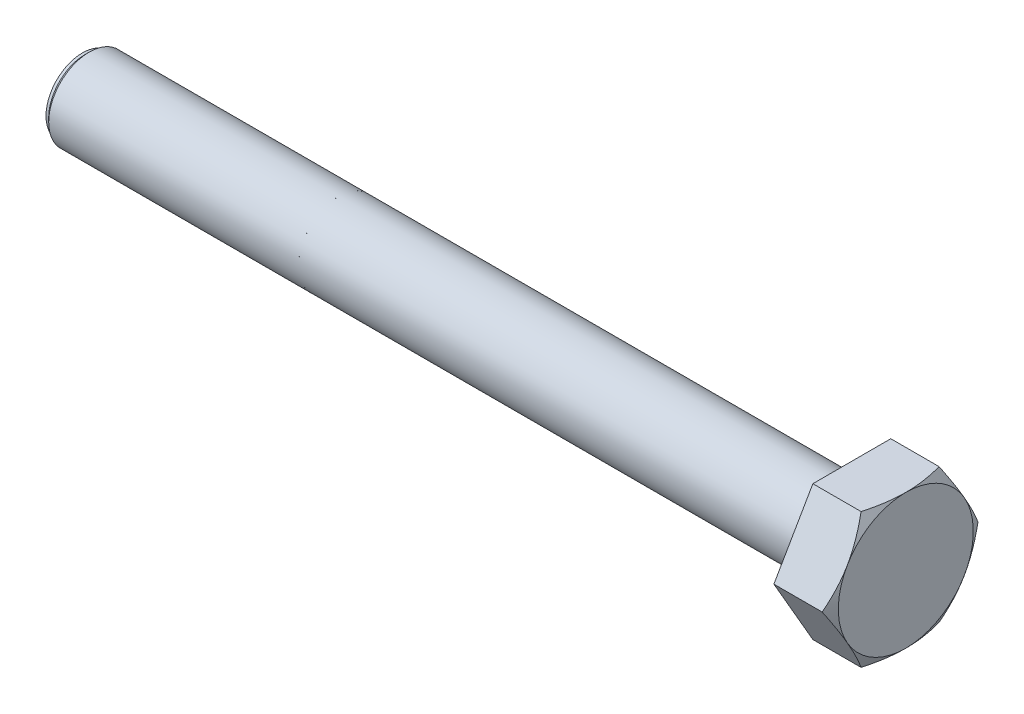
ISO-10303-21;
HEADER;
FILE_DESCRIPTION(('STEP AP214'),'2;1');
FILE_NAME('part.step','',(''),(''),'','','');
FILE_SCHEMA(('AUTOMOTIVE_DESIGN { 1 0 10303 214 1 1 1 1 }'));
ENDSEC;
DATA;
#1=APPLICATION_CONTEXT('core data for automotive mechanical design processes');
#2=APPLICATION_PROTOCOL_DEFINITION('international standard','automotive_design',2000,#1);
#3=PRODUCT_CONTEXT('',#1,'mechanical');
#4=PRODUCT('Part','Part','',(#3));
#5=PRODUCT_RELATED_PRODUCT_CATEGORY('part','',(#4));
#6=PRODUCT_DEFINITION_FORMATION('','',#4);
#7=PRODUCT_DEFINITION_CONTEXT('part definition',#1,'design');
#8=PRODUCT_DEFINITION('design','',#6,#7);
#9=PRODUCT_DEFINITION_SHAPE('','',#8);
#10=(LENGTH_UNIT() NAMED_UNIT(*) SI_UNIT(.MILLI.,.METRE.));
#11=(NAMED_UNIT(*) PLANE_ANGLE_UNIT() SI_UNIT($,.RADIAN.));
#12=(NAMED_UNIT(*) SI_UNIT($,.STERADIAN.) SOLID_ANGLE_UNIT());
#13=UNCERTAINTY_MEASURE_WITH_UNIT(LENGTH_MEASURE(1.E-05),#10,'distance_accuracy_value','');
#14=(GEOMETRIC_REPRESENTATION_CONTEXT(3) GLOBAL_UNCERTAINTY_ASSIGNED_CONTEXT((#13)) GLOBAL_UNIT_ASSIGNED_CONTEXT((#10,
#11,#12)) REPRESENTATION_CONTEXT('',''));
#15=CARTESIAN_POINT('',(0.,0.,0.));
#16=DIRECTION('',(0.,0.,1.));
#17=DIRECTION('',(1.,0.,0.));
#18=AXIS2_PLACEMENT_3D('',#15,#16,#17);
#19=CARTESIAN_POINT('',(-57.,0.,0.));
#20=DIRECTION('',(-1.,0.,0.));
#21=DIRECTION('',(0.,0.,1.));
#22=AXIS2_PLACEMENT_3D('',#19,#20,#21);
#23=CYLINDRICAL_SURFACE('',#22,2.7);
#24=CARTESIAN_POINT('',(-38.,0.,0.));
#25=DIRECTION('',(-1.,0.,0.));
#26=DIRECTION('',(0.,0.,1.));
#27=AXIS2_PLACEMENT_3D('',#24,#25,#26);
#28=CIRCLE('',#27,2.7);
#29=CARTESIAN_POINT('',(-38.,0.,2.7));
#30=VERTEX_POINT('',#29);
#31=EDGE_CURVE('P0_E20',#30,#30,#28,.T.);
#32=ORIENTED_EDGE('',*,*,#31,.T.);
#33=EDGE_LOOP('',(#32));
#34=FACE_BOUND('',#33,.T.);
#35=CARTESIAN_POINT('',(-57.,0.,0.));
#36=DIRECTION('',(-1.,0.,0.));
#37=DIRECTION('',(0.,0.,1.));
#38=AXIS2_PLACEMENT_3D('',#35,#36,#37);
#39=CIRCLE('',#38,2.7);
#40=CARTESIAN_POINT('',(-57.,0.,2.7));
#41=VERTEX_POINT('',#40);
#42=EDGE_CURVE('P0_E11',#41,#41,#39,.F.);
#43=ORIENTED_EDGE('',*,*,#42,.T.);
#44=EDGE_LOOP('',(#43));
#45=FACE_BOUND('',#44,.T.);
#46=ADVANCED_FACE('P0_F16',(#34,#45),#23,.T.);
#47=CARTESIAN_POINT('',(-38.,0.,0.));
#48=DIRECTION('',(-1.,0.,0.));
#49=DIRECTION('',(0.,0.,1.));
#50=AXIS2_PLACEMENT_3D('',#47,#48,#49);
#51=PLANE('',#50);
#52=ORIENTED_EDGE('',*,*,#31,.F.);
#53=EDGE_LOOP('',(#52));
#54=FACE_BOUND('',#53,.T.);
#55=CARTESIAN_POINT('',(-38.,3.,0.));
#56=CARTESIAN_POINT('',(-38.,2.99979758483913,-0.572474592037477));
#57=CARTESIAN_POINT('',(-38.,2.78936490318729,-1.10428412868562));
#58=CARTESIAN_POINT('',(-38.,2.56095382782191,-1.6815290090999));
#59=CARTESIAN_POINT('',(-38.,2.12132034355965,-2.12132034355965));
#60=CARTESIAN_POINT('',(-38.,1.68243191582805,-2.5603663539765));
#61=CARTESIAN_POINT('',(-38.,1.10428412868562,-2.78936490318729));
#62=CARTESIAN_POINT('',(-38.,0.572753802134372,-2.99989874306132));
#63=CARTESIAN_POINT('',(-38.,0.,-3.));
#64=CARTESIAN_POINT('',(-38.,-0.571707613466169,-3.00010107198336));
#65=CARTESIAN_POINT('',(-38.,-1.10428412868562,-2.78936490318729));
#66=CARTESIAN_POINT('',(-38.,-1.68152900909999,-2.56095382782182));
#67=CARTESIAN_POINT('',(-38.,-2.12132034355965,-2.12132034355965));
#68=CARTESIAN_POINT('',(-38.,-2.56036635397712,-1.68243191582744));
#69=CARTESIAN_POINT('',(-38.,-2.78936490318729,-1.10428412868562));
#70=CARTESIAN_POINT('',(-38.,-2.999797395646,-0.573009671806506));
#71=CARTESIAN_POINT('',(-38.,-3.,0.));
#72=B_SPLINE_CURVE_WITH_KNOTS('',2,(#55,#56,#57,#58,#59,#60,#61,#62,#63,#64,#65,#66,#67,#68,#69,
#70,#71),.UNSPECIFIED.,.F.,.F.,(3,2,2,2,2,2,2,2,3),(0.,0.125,0.25,0.375,0.5,0.625,0.75,0.875,
1.),.UNSPECIFIED.);
#73=CARTESIAN_POINT('',(-38.,3.,0.));
#74=VERTEX_POINT('',#73);
#75=CARTESIAN_POINT('',(-38.,-3.,0.));
#76=VERTEX_POINT('',#75);
#77=EDGE_CURVE('P0_E30',#74,#76,#72,.T.);
#78=ORIENTED_EDGE('',*,*,#77,.T.);
#79=CARTESIAN_POINT('',(-38.,-3.,0.));
#80=CARTESIAN_POINT('',(-38.,-2.99979758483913,0.572474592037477));
#81=CARTESIAN_POINT('',(-38.,-2.78936490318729,1.10428412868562));
#82=CARTESIAN_POINT('',(-38.,-2.56095382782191,1.6815290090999));
#83=CARTESIAN_POINT('',(-38.,-2.12132034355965,2.12132034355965));
#84=CARTESIAN_POINT('',(-38.,-1.68243191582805,2.5603663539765));
#85=CARTESIAN_POINT('',(-38.,-1.10428412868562,2.78936490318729));
#86=CARTESIAN_POINT('',(-38.,-0.572753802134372,2.99989874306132));
#87=CARTESIAN_POINT('',(-38.,0.,3.));
#88=CARTESIAN_POINT('',(-38.,0.571707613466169,3.00010107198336));
#89=CARTESIAN_POINT('',(-38.,1.10428412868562,2.78936490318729));
#90=CARTESIAN_POINT('',(-38.,1.68152900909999,2.56095382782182));
#91=CARTESIAN_POINT('',(-38.,2.12132034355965,2.12132034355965));
#92=CARTESIAN_POINT('',(-38.,2.56036635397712,1.68243191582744));
#93=CARTESIAN_POINT('',(-38.,2.78936490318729,1.10428412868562));
#94=CARTESIAN_POINT('',(-38.,2.999797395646,0.573009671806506));
#95=CARTESIAN_POINT('',(-38.,3.,0.));
#96=B_SPLINE_CURVE_WITH_KNOTS('',2,(#79,#80,#81,#82,#83,#84,#85,#86,#87,#88,#89,#90,#91,#92,#93,
#94,#95),.UNSPECIFIED.,.F.,.F.,(3,2,2,2,2,2,2,2,3),(0.,0.125,0.25,0.375,0.5,0.625,0.75,0.875,
1.),.UNSPECIFIED.);
#97=EDGE_CURVE('P0_E33',#76,#74,#96,.T.);
#98=ORIENTED_EDGE('',*,*,#97,.T.);
#99=EDGE_LOOP('',(#78,#98));
#100=FACE_BOUND('',#99,.T.);
#101=ADVANCED_FACE('P0_F17',(#54,#100),#51,.T.);
#102=OPEN_SHELL('',(#46,#101));
#103=SHELL_BASED_SURFACE_MODEL('P0_B1',(#102));
#104=CARTESIAN_POINT('',(4.,0.,0.));
#105=DIRECTION('',(1.,0.,0.));
#106=DIRECTION('',(0.,0.,-1.));
#107=AXIS2_PLACEMENT_3D('',#104,#105,#106);
#108=PLANE('',#107);
#109=CARTESIAN_POINT('',(4.00000000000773,0.,0.));
#110=DIRECTION('',(-1.,0.,0.));
#111=DIRECTION('',(0.,-1.,0.));
#112=AXIS2_PLACEMENT_3D('',#109,#110,#111);
#113=CIRCLE('',#112,4.99999999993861);
#114=CARTESIAN_POINT('',(4.00000000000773,2.50000000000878,4.33012701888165));
#115=VERTEX_POINT('',#114);
#116=CARTESIAN_POINT('',(4.00000000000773,4.99999999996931,-3.70289623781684E-11));
#117=VERTEX_POINT('',#116);
#118=EDGE_CURVE('P1_E341',#115,#117,#113,.T.);
#119=ORIENTED_EDGE('',*,*,#118,.F.);
#120=CARTESIAN_POINT('',(4.00000000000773,0.,0.));
#121=DIRECTION('',(-1.,0.,0.));
#122=DIRECTION('',(0.,-1.,0.));
#123=AXIS2_PLACEMENT_3D('',#120,#121,#122);
#124=CIRCLE('',#123,4.99999999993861);
#125=CARTESIAN_POINT('',(4.00000000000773,-2.50000000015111,4.33012701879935));
#126=VERTEX_POINT('',#125);
#127=EDGE_CURVE('P1_E96',#126,#115,#124,.T.);
#128=ORIENTED_EDGE('',*,*,#127,.F.);
#129=CARTESIAN_POINT('',(4.00000000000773,0.,0.));
#130=DIRECTION('',(-1.,0.,0.));
#131=DIRECTION('',(0.,-1.,0.));
#132=AXIS2_PLACEMENT_3D('',#129,#130,#131);
#133=CIRCLE('',#132,4.99999999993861);
#134=CARTESIAN_POINT('',(4.00000000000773,-4.99999999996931,3.70311420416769E-11));
#135=VERTEX_POINT('',#134);
#136=EDGE_CURVE('P1_E91',#135,#126,#133,.T.);
#137=ORIENTED_EDGE('',*,*,#136,.F.);
#138=CARTESIAN_POINT('',(4.00000000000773,0.,0.));
#139=DIRECTION('',(-1.,0.,0.));
#140=DIRECTION('',(0.,-1.,0.));
#141=AXIS2_PLACEMENT_3D('',#138,#139,#140);
#142=CIRCLE('',#141,4.99999999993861);
#143=CARTESIAN_POINT('',(4.00000000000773,-2.49999999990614,-4.33012701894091));
#144=VERTEX_POINT('',#143);
#145=EDGE_CURVE('P1_E93',#144,#135,#142,.T.);
#146=ORIENTED_EDGE('',*,*,#145,.F.);
#147=CARTESIAN_POINT('',(4.00000000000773,0.,0.));
#148=DIRECTION('',(-1.,0.,0.));
#149=DIRECTION('',(0.,-1.,0.));
#150=AXIS2_PLACEMENT_3D('',#147,#148,#149);
#151=CIRCLE('',#150,4.99999999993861);
#152=CARTESIAN_POINT('',(4.00000000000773,2.50000003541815,-4.33012699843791));
#153=VERTEX_POINT('',#152);
#154=EDGE_CURVE('P1_E110',#153,#144,#151,.T.);
#155=ORIENTED_EDGE('',*,*,#154,.F.);
#156=CARTESIAN_POINT('',(4.00000000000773,0.,0.));
#157=DIRECTION('',(-1.,0.,0.));
#158=DIRECTION('',(0.,-1.,0.));
#159=AXIS2_PLACEMENT_3D('',#156,#157,#158);
#160=CIRCLE('',#159,4.99999999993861);
#161=EDGE_CURVE('P1_E334',#117,#153,#160,.T.);
#162=ORIENTED_EDGE('',*,*,#161,.F.);
#163=EDGE_LOOP('',(#119,#128,#137,#146,#155,#162));
#164=FACE_BOUND('',#163,.T.);
#165=ADVANCED_FACE('P1_F16',(#164),#108,.T.);
#166=CARTESIAN_POINT('',(3.57202096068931,0.,0.));
#167=DIRECTION('',(-1.,0.,0.));
#168=DIRECTION('',(0.,-1.,0.));
#169=AXIS2_PLACEMENT_3D('',#166,#167,#168);
#170=CONICAL_SURFACE('',#169,5.77814370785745,1.06795311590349);
#171=CARTESIAN_POINT('',(3.99999999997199,-4.99999999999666,5.55457286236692E-11));
#172=CARTESIAN_POINT('',(4.00001881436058,-4.9999999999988,0.122320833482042));
#173=CARTESIAN_POINT('',(3.99753164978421,-4.99999999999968,0.244636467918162));
#174=CARTESIAN_POINT('',(3.98768504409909,-5.00000000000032,0.489050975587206));
#175=CARTESIAN_POINT('',(3.98032645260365,-5.00000000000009,0.611149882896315));
#176=CARTESIAN_POINT('',(3.9609209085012,-4.99999999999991,0.854411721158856));
#177=CARTESIAN_POINT('',(3.94889547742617,-4.99999999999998,0.975576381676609));
#178=CARTESIAN_POINT('',(3.920408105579,-5.00000000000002,1.21738164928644));
#179=CARTESIAN_POINT('',(3.9039460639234,-5.00000000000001,1.33802224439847));
#180=CARTESIAN_POINT('',(3.84839677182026,-4.99999999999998,1.698702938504));
#181=CARTESIAN_POINT('',(3.80312199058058,-4.99999999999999,1.9377906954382));
#182=CARTESIAN_POINT('',(3.69862839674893,-5.00000000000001,2.41408710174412));
#183=CARTESIAN_POINT('',(3.63934598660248,-5.00000000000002,2.65128192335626));
#184=CARTESIAN_POINT('',(3.57457351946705,-5.,2.88675134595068));
#185=B_SPLINE_CURVE_WITH_KNOTS('',3,(#171,#172,#173,#174,#175,#176,#177,#178,#179,#180,#181,
#182,#183,#184),.UNSPECIFIED.,.F.,.F.,(4,2,2,2,2,2,4),(0.,0.366928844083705,0.733793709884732,
1.09898647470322,1.46418754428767,2.19372244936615,2.92663549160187),.UNSPECIFIED.);
#186=CARTESIAN_POINT('',(3.57457351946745,-5.00000000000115,2.8867513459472));
#187=VERTEX_POINT('',#186);
#188=EDGE_CURVE('P1_E113',#135,#187,#185,.T.);
#189=ORIENTED_EDGE('',*,*,#188,.F.);
#190=ORIENTED_EDGE('',*,*,#136,.T.);
#191=CARTESIAN_POINT('',(3.57457351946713,-5.0000000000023,2.88675134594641));
#192=CARTESIAN_POINT('',(3.63934598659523,-4.79607749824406,3.00448605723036));
#193=CARTESIAN_POINT('',(3.69862839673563,-4.5906607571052,3.12308346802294));
#194=CARTESIAN_POINT('',(3.8031219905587,-4.17817596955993,3.36123167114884));
#195=CARTESIAN_POINT('',(3.84839677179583,-3.9711198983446,3.48077554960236));
#196=CARTESIAN_POINT('',(3.90394606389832,-3.65876125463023,3.66111589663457));
#197=CARTESIAN_POINT('',(3.92040810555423,-3.5542834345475,3.72143619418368));
#198=CARTESIAN_POINT('',(3.94889547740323,-3.34487393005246,3.84233882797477));
#199=CARTESIAN_POINT('',(3.96092090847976,-3.23994225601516,3.90292115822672));
#200=CARTESIAN_POINT('',(3.98032645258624,-3.02927132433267,4.02455207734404));
#201=CARTESIAN_POINT('',(3.98768504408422,-2.92353056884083,4.08560153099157));
#202=CARTESIAN_POINT('',(3.99753164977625,-2.71186139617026,4.20780878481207));
#203=CARTESIAN_POINT('',(4.000018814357,-2.60593294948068,4.26896660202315));
#204=CARTESIAN_POINT('',(3.99999999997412,-2.5000000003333,4.33012701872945));
#205=B_SPLINE_CURVE_WITH_KNOTS('',3,(#191,#192,#193,#194,#195,#196,#197,#198,#199,#200,#201,
#202,#203,#204),.UNSPECIFIED.,.F.,.F.,(4,2,2,2,2,2,4),(0.,0.732913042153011,1.46244794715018,
1.82764901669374,2.19284178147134,2.55970664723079,2.92663549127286),.UNSPECIFIED.);
#206=EDGE_CURVE('P1_E116',#187,#126,#205,.T.);
#207=ORIENTED_EDGE('',*,*,#206,.F.);
#208=EDGE_LOOP('',(#189,#190,#207));
#209=FACE_BOUND('',#208,.T.);
#210=ADVANCED_FACE('P1_F114',(#209),#170,.T.);
#211=CARTESIAN_POINT('',(3.57202096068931,0.,0.));
#212=DIRECTION('',(-1.,0.,0.));
#213=DIRECTION('',(0.,-1.,0.));
#214=AXIS2_PLACEMENT_3D('',#211,#212,#213);
#215=CONICAL_SURFACE('',#214,5.77814370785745,1.06795311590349);
#216=CARTESIAN_POINT('',(3.99999999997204,-2.49999999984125,-4.33012701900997));
#217=CARTESIAN_POINT('',(4.00001881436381,-2.60593294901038,-4.26896660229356));
#218=CARTESIAN_POINT('',(3.99753164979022,-2.71186139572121,-4.20780878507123));
#219=CARTESIAN_POINT('',(3.98768504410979,-2.92353056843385,-4.08560153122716));
#220=CARTESIAN_POINT('',(3.98032645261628,-3.02927132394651,-4.02455207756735));
#221=CARTESIAN_POINT('',(3.96092090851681,-3.23994225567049,-3.90292115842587));
#222=CARTESIAN_POINT('',(3.94889547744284,-3.34487392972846,-3.84233882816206));
#223=CARTESIAN_POINT('',(3.92040810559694,-3.55428343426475,-3.72143619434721));
#224=CARTESIAN_POINT('',(3.90394606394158,-3.65876125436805,-3.66111589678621));
#225=CARTESIAN_POINT('',(3.84839677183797,-3.97111989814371,-3.48077554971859));
#226=CARTESIAN_POINT('',(3.80312199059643,-4.17817596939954,-3.36123167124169));
#227=CARTESIAN_POINT('',(3.69862839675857,-4.59066075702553,-3.12308346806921));
#228=CARTESIAN_POINT('',(3.63934598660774,-4.79607749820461,-3.00448605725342));
#229=CARTESIAN_POINT('',(3.57457351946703,-5.00000000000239,-2.88675134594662));
#230=B_SPLINE_CURVE_WITH_KNOTS('',3,(#216,#217,#218,#219,#220,#221,#222,#223,#224,#225,#226,
#227,#228,#229),.UNSPECIFIED.,.F.,.F.,(4,2,2,2,2,2,4),(0.,0.36692884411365,0.733793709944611,
1.09898647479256,1.46418754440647,2.19372244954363,2.92663549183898),.UNSPECIFIED.);
#231=CARTESIAN_POINT('',(3.57457351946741,-5.,-2.88675134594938));
#232=VERTEX_POINT('',#231);
#233=EDGE_CURVE('P1_E108',#144,#232,#230,.T.);
#234=ORIENTED_EDGE('',*,*,#233,.F.);
#235=ORIENTED_EDGE('',*,*,#145,.T.);
#236=CARTESIAN_POINT('',(3.57457351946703,-5.,-2.88675134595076));
#237=CARTESIAN_POINT('',(3.63934598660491,-5.,-2.6512819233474));
#238=CARTESIAN_POINT('',(3.69862839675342,-5.,-2.41408710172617));
#239=CARTESIAN_POINT('',(3.80312199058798,-5.,-1.93779069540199));
#240=CARTESIAN_POINT('',(3.84839677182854,-5.,-1.69870293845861));
#241=CARTESIAN_POINT('',(3.90394606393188,-5.,-1.33802224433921));
#242=CARTESIAN_POINT('',(3.92040810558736,-5.,-1.21738164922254));
#243=CARTESIAN_POINT('',(3.94889547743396,-5.,-0.975576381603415));
#244=CARTESIAN_POINT('',(3.96092090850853,-5.,-0.854411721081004));
#245=CARTESIAN_POINT('',(3.98032645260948,-5.,-0.611149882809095));
#246=CARTESIAN_POINT('',(3.98768504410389,-5.,-0.489050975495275));
#247=CARTESIAN_POINT('',(3.99753164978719,-5.,-0.244636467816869));
#248=CARTESIAN_POINT('',(4.00001881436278,-5.,-0.122320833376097));
#249=CARTESIAN_POINT('',(3.99999999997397,-5.,5.50028560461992E-11));
#250=B_SPLINE_CURVE_WITH_KNOTS('',3,(#236,#237,#238,#239,#240,#241,#242,#243,#244,#245,#246,
#247,#248,#249),.UNSPECIFIED.,.F.,.F.,(4,2,2,2,2,2,4),(0.,0.732913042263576,1.46244794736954,
1.82764901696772,2.19284178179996,2.55970664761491,2.9266354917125),.UNSPECIFIED.);
#251=EDGE_CURVE('P1_E105',#232,#135,#250,.T.);
#252=ORIENTED_EDGE('',*,*,#251,.F.);
#253=EDGE_LOOP('',(#234,#235,#252));
#254=FACE_BOUND('',#253,.T.);
#255=ADVANCED_FACE('P1_F103',(#254),#215,.T.);
#256=CARTESIAN_POINT('',(3.57202096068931,0.,0.));
#257=DIRECTION('',(-1.,0.,0.));
#258=DIRECTION('',(0.,-1.,0.));
#259=AXIS2_PLACEMENT_3D('',#256,#257,#258);
#260=CONICAL_SURFACE('',#259,5.77814370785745,1.06795311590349);
#261=CARTESIAN_POINT('',(3.99999999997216,2.50000007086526,-4.33012697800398));
#262=CARTESIAN_POINT('',(4.00001881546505,2.39406711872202,-4.39128739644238));
#263=CARTESIAN_POINT('',(3.99753165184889,2.28813866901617,-4.4524452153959));
#264=CARTESIAN_POINT('',(3.98768504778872,2.07646949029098,-4.57465247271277));
#265=CARTESIAN_POINT('',(3.9803264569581,1.97072873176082,-4.63570192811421));
#266=CARTESIAN_POINT('',(3.96092091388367,1.76005779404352,-4.75733285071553));
#267=CARTESIAN_POINT('',(3.94889548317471,1.65512611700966,-4.81791518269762));
#268=CARTESIAN_POINT('',(3.92040811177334,1.44571660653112,-4.93881781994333));
#269=CARTESIAN_POINT('',(3.9039460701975,1.34123878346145,-4.99913811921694));
#270=CARTESIAN_POINT('',(3.84839677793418,1.02888013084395,-5.17947847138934));
#271=CARTESIAN_POINT('',(3.80312199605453,0.821824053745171,-5.29902235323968));
#272=CARTESIAN_POINT('',(3.69862840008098,0.409339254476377,-5.53717056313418));
#273=CARTESIAN_POINT('',(3.63934598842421,0.203922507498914,-5.65576797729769));
#274=CARTESIAN_POINT('',(3.57457351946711,-2.47312655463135E-12,-5.77350269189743));
#275=B_SPLINE_CURVE_WITH_KNOTS('',3,(#261,#262,#263,#264,#265,#266,#267,#268,#269,#270,#271,
#272,#273,#274),.UNSPECIFIED.,.F.,.F.,(4,2,2,2,2,2,4),(0.,0.366928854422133,0.733793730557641,
1.09898650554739,1.46418758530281,2.19372251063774,2.92663557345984),.UNSPECIFIED.);
#276=CARTESIAN_POINT('',(3.57457351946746,1.1383297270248E-12,-5.77350269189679));
#277=VERTEX_POINT('',#276);
#278=EDGE_CURVE('P1_E190',#153,#277,#275,.T.);
#279=ORIENTED_EDGE('',*,*,#278,.F.);
#280=ORIENTED_EDGE('',*,*,#154,.T.);
#281=CARTESIAN_POINT('',(3.57457351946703,2.27679475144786E-12,-5.77350269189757));
#282=CARTESIAN_POINT('',(3.63934598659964,-0.203922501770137,-5.65576798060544));
#283=CARTESIAN_POINT('',(3.69862839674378,-0.409339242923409,-5.53717056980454));
#284=CARTESIAN_POINT('',(3.80312199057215,-0.821824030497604,-5.29902236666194));
#285=CARTESIAN_POINT('',(3.84839677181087,-1.02888010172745,-5.17947848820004));
#286=CARTESIAN_POINT('',(3.90394606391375,-1.34123874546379,-4.99913814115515));
#287=CARTESIAN_POINT('',(3.92040810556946,-1.4457165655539,-4.93881784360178));
#288=CARTESIAN_POINT('',(3.94889547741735,-1.65512607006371,-4.81791520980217));
#289=CARTESIAN_POINT('',(3.96092090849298,-1.7600577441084,-4.75733287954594));
#290=CARTESIAN_POINT('',(3.98032645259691,-1.97072867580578,-4.63570196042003));
#291=CARTESIAN_POINT('',(3.98768504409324,-2.07646943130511,-4.57465250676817));
#292=CARTESIAN_POINT('',(3.99753164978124,-2.28813860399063,-4.45244525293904));
#293=CARTESIAN_POINT('',(4.00001881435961,-2.39406705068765,-4.39128743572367));
#294=CARTESIAN_POINT('',(3.999999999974,-2.49999999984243,-4.3301270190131));
#295=B_SPLINE_CURVE_WITH_KNOTS('',3,(#281,#282,#283,#284,#285,#286,#287,#288,#289,#290,#291,
#292,#293,#294),.UNSPECIFIED.,.F.,.F.,(4,2,2,2,2,2,4),(0.,0.732913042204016,1.46244794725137,
1.82764901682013,2.19284178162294,2.55970664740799,2.92663549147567),.UNSPECIFIED.);
#296=EDGE_CURVE('P1_E164',#277,#144,#295,.T.);
#297=ORIENTED_EDGE('',*,*,#296,.F.);
#298=EDGE_LOOP('',(#279,#280,#297));
#299=FACE_BOUND('',#298,.T.);
#300=ADVANCED_FACE('P1_F152',(#299),#260,.T.);
#301=CARTESIAN_POINT('',(3.57202096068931,0.,0.));
#302=DIRECTION('',(-1.,0.,0.));
#303=DIRECTION('',(0.,-1.,0.));
#304=AXIS2_PLACEMENT_3D('',#301,#302,#303);
#305=CONICAL_SURFACE('',#304,5.77814370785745,1.06795311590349);
#306=CARTESIAN_POINT('',(3.99999999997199,4.99999999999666,-7.40601720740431E-11));
#307=CARTESIAN_POINT('',(4.00001881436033,4.9999999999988,-0.122320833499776));
#308=CARTESIAN_POINT('',(3.99753164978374,4.99999999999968,-0.244636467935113));
#309=CARTESIAN_POINT('',(3.98768504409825,5.00000000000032,-0.489050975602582));
#310=CARTESIAN_POINT('',(3.98032645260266,5.00000000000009,-0.611149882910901));
#311=CARTESIAN_POINT('',(3.96092090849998,4.99999999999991,-0.854411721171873));
#312=CARTESIAN_POINT('',(3.94889547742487,4.99999999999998,-0.975576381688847));
#313=CARTESIAN_POINT('',(3.9204081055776,5.00000000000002,-1.21738164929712));
#314=CARTESIAN_POINT('',(3.90394606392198,5.00000000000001,-1.33802224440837));
#315=CARTESIAN_POINT('',(3.84839677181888,4.99999999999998,-1.69870293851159));
#316=CARTESIAN_POINT('',(3.80312199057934,4.99999999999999,-1.93779069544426));
#317=CARTESIAN_POINT('',(3.69862839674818,5.00000000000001,-2.41408710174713));
#318=CARTESIAN_POINT('',(3.63934598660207,5.00000000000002,-2.65128192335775));
#319=CARTESIAN_POINT('',(3.57457351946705,5.,-2.88675134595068));
#320=B_SPLINE_CURVE_WITH_KNOTS('',3,(#306,#307,#308,#309,#310,#311,#312,#313,#314,#315,#316,
#317,#318,#319),.UNSPECIFIED.,.F.,.F.,(4,2,2,2,2,2,4),(0.,0.366928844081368,0.733793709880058,
1.09898647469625,1.4641875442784,2.1937224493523,2.92663549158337),.UNSPECIFIED.);
#321=CARTESIAN_POINT('',(3.57457351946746,5.00000000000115,-2.8867513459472));
#322=VERTEX_POINT('',#321);
#323=EDGE_CURVE('P1_E206',#117,#322,#320,.T.);
#324=ORIENTED_EDGE('',*,*,#323,.F.);
#325=ORIENTED_EDGE('',*,*,#161,.T.);
#326=CARTESIAN_POINT('',(3.57457351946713,5.0000000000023,-2.88675134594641));
#327=CARTESIAN_POINT('',(3.63934598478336,4.79607750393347,-3.00448605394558));
#328=CARTESIAN_POINT('',(3.69862839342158,4.59066076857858,-3.12308346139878));
#329=CARTESIAN_POINT('',(3.80312198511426,4.17817599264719,-3.3612316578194));
#330=CARTESIAN_POINT('',(3.84839676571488,3.97111992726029,-3.48077553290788));
#331=CARTESIAN_POINT('',(3.90394605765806,3.65876129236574,-3.66111587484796));
#332=CARTESIAN_POINT('',(3.9204080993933,3.55428347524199,-3.7214361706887));
#333=CARTESIAN_POINT('',(3.94889547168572,3.34487397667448,-3.84233880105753));
#334=CARTESIAN_POINT('',(3.96092090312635,3.23994230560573,-3.90292112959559));
#335=CARTESIAN_POINT('',(3.98032644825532,3.02927137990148,-4.02455204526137));
#336=CARTESIAN_POINT('',(3.98768504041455,2.92353062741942,-4.08560149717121));
#337=CARTESIAN_POINT('',(3.99753164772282,2.71186146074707,-4.20780874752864));
#338=CARTESIAN_POINT('',(4.00001881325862,2.60593301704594,-4.26896656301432));
#339=CARTESIAN_POINT('',(3.99999999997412,2.50000007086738,-4.33012697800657));
#340=B_SPLINE_CURVE_WITH_KNOTS('',3,(#326,#327,#328,#329,#330,#331,#332,#333,#334,#335,#336,
#337,#338,#339),.UNSPECIFIED.,.F.,.F.,(4,2,2,2,2,2,4),(0.,0.732913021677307,1.46244790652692,
1.82764896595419,2.19284172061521,2.55970657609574,2.92663540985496),.UNSPECIFIED.);
#341=EDGE_CURVE('P1_E165',#322,#153,#340,.T.);
#342=ORIENTED_EDGE('',*,*,#341,.F.);
#343=EDGE_LOOP('',(#324,#325,#342));
#344=FACE_BOUND('',#343,.T.);
#345=ADVANCED_FACE('P1_F333',(#344),#305,.T.);
#346=CARTESIAN_POINT('',(3.57202096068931,0.,0.));
#347=DIRECTION('',(-1.,0.,0.));
#348=DIRECTION('',(0.,-1.,0.));
#349=AXIS2_PLACEMENT_3D('',#346,#347,#348);
#350=CONICAL_SURFACE('',#349,5.77814370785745,1.06795311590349);
#351=CARTESIAN_POINT('',(3.99999999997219,-2.5000000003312,4.33012701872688));
#352=CARTESIAN_POINT('',(4.00001881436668,-2.39406705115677,4.39128743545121));
#353=CARTESIAN_POINT('',(3.99753164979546,-2.28813860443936,4.45244525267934));
#354=CARTESIAN_POINT('',(3.98768504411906,-2.07646943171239,4.57465250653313));
#355=CARTESIAN_POINT('',(3.98032645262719,-1.970728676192,4.63570196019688));
#356=CARTESIAN_POINT('',(3.96092090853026,-1.76005774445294,4.75733287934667));
#357=CARTESIAN_POINT('',(3.9488954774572,-1.65512607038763,4.81791520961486));
#358=CARTESIAN_POINT('',(3.92040810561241,-1.44571656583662,4.93881784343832));
#359=CARTESIAN_POINT('',(3.90394606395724,-1.34123874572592,4.99913814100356));
#360=CARTESIAN_POINT('',(3.84839677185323,-1.02888010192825,5.17947848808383));
#361=CARTESIAN_POINT('',(3.80312199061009,-0.821824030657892,5.29902236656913));
#362=CARTESIAN_POINT('',(3.69862839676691,-0.409339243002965,5.53717056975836));
#363=CARTESIAN_POINT('',(3.63934598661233,-0.203922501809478,5.65576798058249));
#364=CARTESIAN_POINT('',(3.5745735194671,2.5057332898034E-12,5.77350269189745));
#365=B_SPLINE_CURVE_WITH_KNOTS('',3,(#351,#352,#353,#354,#355,#356,#357,#358,#359,#360,#361,
#362,#363,#364),.UNSPECIFIED.,.F.,.F.,(4,2,2,2,2,2,4),(0.,0.366928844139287,0.733793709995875,
1.09898647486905,1.46418754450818,2.19372244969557,2.92663549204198),.UNSPECIFIED.);
#366=CARTESIAN_POINT('',(3.57457351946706,1.14481456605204E-13,5.77350269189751));
#367=VERTEX_POINT('',#366);
#368=EDGE_CURVE('P1_E126',#126,#367,#365,.T.);
#369=ORIENTED_EDGE('',*,*,#368,.F.);
#370=ORIENTED_EDGE('',*,*,#127,.T.);
#371=CARTESIAN_POINT('',(3.57457351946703,-2.27668896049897E-12,5.77350269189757));
#372=CARTESIAN_POINT('',(3.63934598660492,0.203922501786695,5.65576798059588));
#373=CARTESIAN_POINT('',(3.69862839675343,0.409339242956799,5.53717056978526));
#374=CARTESIAN_POINT('',(3.80312199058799,0.821824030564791,5.29902236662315));
#375=CARTESIAN_POINT('',(3.84839677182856,1.0288801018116,5.17947848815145));
#376=CARTESIAN_POINT('',(3.90394606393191,1.34123874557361,4.99913814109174));
#377=CARTESIAN_POINT('',(3.92040810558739,1.44571656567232,4.9388178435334));
#378=CARTESIAN_POINT('',(3.94889547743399,1.65512607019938,4.81791520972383));
#379=CARTESIAN_POINT('',(3.96092090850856,1.76005774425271,4.75733287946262));
#380=CARTESIAN_POINT('',(3.98032645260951,1.97072867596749,4.63570196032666));
#381=CARTESIAN_POINT('',(3.98768504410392,2.07646943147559,4.57465250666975));
#382=CARTESIAN_POINT('',(3.99753164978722,2.28813860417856,4.45244525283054));
#383=CARTESIAN_POINT('',(4.00001881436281,2.39406705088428,4.39128743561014));
#384=CARTESIAN_POINT('',(3.999999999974,2.5000000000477,4.33012701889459));
#385=B_SPLINE_CURVE_WITH_KNOTS('',3,(#371,#372,#373,#374,#375,#376,#377,#378,#379,#380,#381,
#382,#383,#384),.UNSPECIFIED.,.F.,.F.,(4,2,2,2,2,2,4),(0.,0.732913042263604,1.46244794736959,
1.82764901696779,2.19284178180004,2.559706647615,2.92663549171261),.UNSPECIFIED.);
#386=EDGE_CURVE('P1_E230',#367,#115,#385,.T.);
#387=ORIENTED_EDGE('',*,*,#386,.F.);
#388=EDGE_LOOP('',(#369,#370,#387));
#389=FACE_BOUND('',#388,.T.);
#390=ADVANCED_FACE('P1_F216',(#389),#350,.T.);
#391=CARTESIAN_POINT('',(3.57202096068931,0.,0.));
#392=DIRECTION('',(-1.,0.,0.));
#393=DIRECTION('',(0.,-1.,0.));
#394=AXIS2_PLACEMENT_3D('',#391,#392,#393);
#395=CONICAL_SURFACE('',#394,5.77814370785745,1.06795311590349);
#396=CARTESIAN_POINT('',(3.99999999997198,2.50000000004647,4.33012701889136));
#397=CARTESIAN_POINT('',(4.00001881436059,2.605932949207,4.26896660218));
#398=CARTESIAN_POINT('',(3.99753164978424,2.71186139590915,4.20780878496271));
#399=CARTESIAN_POINT('',(3.98768504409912,2.92353056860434,4.08560153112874));
#400=CARTESIAN_POINT('',(3.98032645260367,3.02927132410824,4.02455207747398));
#401=CARTESIAN_POINT('',(3.96092090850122,3.23994225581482,3.90292115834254));
#402=CARTESIAN_POINT('',(3.94889547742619,3.34487392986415,3.84233882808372));
#403=CARTESIAN_POINT('',(3.92040810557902,3.55428343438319,3.72143619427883));
#404=CARTESIAN_POINT('',(3.90394606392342,3.65876125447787,3.6611158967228));
#405=CARTESIAN_POINT('',(3.84839677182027,3.97111989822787,3.48077554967));
#406=CARTESIAN_POINT('',(3.80312199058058,4.17817596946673,3.3612316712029));
#407=CARTESIAN_POINT('',(3.69862839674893,4.59066075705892,3.12308346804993));
#408=CARTESIAN_POINT('',(3.63934598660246,4.79607749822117,3.00448605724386));
#409=CARTESIAN_POINT('',(3.57457351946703,5.00000000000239,2.88675134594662));
#410=B_SPLINE_CURVE_WITH_KNOTS('',3,(#396,#397,#398,#399,#400,#401,#402,#403,#404,#405,#406,
#407,#408,#409),.UNSPECIFIED.,.F.,.F.,(4,2,2,2,2,2,4),(0.,0.366928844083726,0.733793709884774,
1.09898647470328,1.46418754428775,2.19372244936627,2.92663549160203),.UNSPECIFIED.);
#411=CARTESIAN_POINT('',(3.57457351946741,5.,2.88675134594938));
#412=VERTEX_POINT('',#411);
#413=EDGE_CURVE('P1_E222',#115,#412,#410,.T.);
#414=ORIENTED_EDGE('',*,*,#413,.F.);
#415=ORIENTED_EDGE('',*,*,#118,.T.);
#416=CARTESIAN_POINT('',(3.57457351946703,5.,2.88675134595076));
#417=CARTESIAN_POINT('',(3.63934598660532,5.,2.6512819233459));
#418=CARTESIAN_POINT('',(3.69862839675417,5.,2.41408710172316));
#419=CARTESIAN_POINT('',(3.80312199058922,5.,1.93779069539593));
#420=CARTESIAN_POINT('',(3.84839677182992,5.,1.69870293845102));
#421=CARTESIAN_POINT('',(3.9039460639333,5.,1.33802224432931));
#422=CARTESIAN_POINT('',(3.92040810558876,5.,1.21738164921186));
#423=CARTESIAN_POINT('',(3.94889547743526,5.,0.975576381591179));
#424=CARTESIAN_POINT('',(3.96092090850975,5.,0.854411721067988));
#425=CARTESIAN_POINT('',(3.98032645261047,5.,0.61114988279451));
#426=CARTESIAN_POINT('',(3.98768504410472,5.,0.489050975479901));
#427=CARTESIAN_POINT('',(3.99753164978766,5.,0.244636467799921));
#428=CARTESIAN_POINT('',(4.00001881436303,5.,0.122320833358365));
#429=CARTESIAN_POINT('',(3.99999999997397,5.,-7.35149366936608E-11));
#430=B_SPLINE_CURVE_WITH_KNOTS('',3,(#416,#417,#418,#419,#420,#421,#422,#423,#424,#425,#426,
#427,#428,#429),.UNSPECIFIED.,.F.,.F.,(4,2,2,2,2,2,4),(0.,0.73291304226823,1.46244794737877,
1.82764901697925,2.19284178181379,2.55970664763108,2.92663549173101),.UNSPECIFIED.);
#431=EDGE_CURVE('P1_E198',#412,#117,#430,.T.);
#432=ORIENTED_EDGE('',*,*,#431,.F.);
#433=EDGE_LOOP('',(#414,#415,#432));
#434=FACE_BOUND('',#433,.T.);
#435=ADVANCED_FACE('P1_F212',(#434),#395,.T.);
#436=CARTESIAN_POINT('',(0.,0.,5.773502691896));
#437=DIRECTION('',(0.,-0.500000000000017,0.866025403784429));
#438=DIRECTION('',(0.,-0.866025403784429,-0.500000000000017));
#439=AXIS2_PLACEMENT_3D('',#436,#437,#438);
#440=PLANE('',#439);
#441=ORIENTED_EDGE('',*,*,#206,.T.);
#442=ORIENTED_EDGE('',*,*,#368,.T.);
#443=DIRECTION('',(1.,0.,0.));
#444=VECTOR('',#443,1.);
#445=CARTESIAN_POINT('',(0.,1.11889664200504E-13,5.77350269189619));
#446=LINE('',#445,#444);
#447=CARTESIAN_POINT('',(0.,1.11889664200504E-13,5.77350269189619));
#448=VERTEX_POINT('',#447);
#449=EDGE_CURVE('P1_E348',#448,#367,#446,.T.);
#450=ORIENTED_EDGE('',*,*,#449,.F.);
#451=DIRECTION('',(0.,-0.866025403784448,-0.499999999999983));
#452=VECTOR('',#451,1.);
#453=CARTESIAN_POINT('',(0.,0.,5.773502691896));
#454=LINE('',#453,#452);
#455=CARTESIAN_POINT('',(0.,-5.,2.88675134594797));
#456=VERTEX_POINT('',#455);
#457=EDGE_CURVE('P1_E229',#448,#456,#454,.T.);
#458=ORIENTED_EDGE('',*,*,#457,.T.);
#459=DIRECTION('',(1.,0.,0.));
#460=VECTOR('',#459,1.);
#461=CARTESIAN_POINT('',(0.,-5.,2.886751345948));
#462=LINE('',#461,#460);
#463=EDGE_CURVE('P1_E124',#187,#456,#462,.F.);
#464=ORIENTED_EDGE('',*,*,#463,.F.);
#465=EDGE_LOOP('',(#441,#442,#450,#458,#464));
#466=FACE_BOUND('',#465,.T.);
#467=ADVANCED_FACE('P1_F215',(#466),#440,.T.);
#468=CARTESIAN_POINT('',(0.,-5.,2.886751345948));
#469=DIRECTION('',(0.,-1.,0.));
#470=DIRECTION('',(0.,0.,-1.));
#471=AXIS2_PLACEMENT_3D('',#468,#469,#470);
#472=PLANE('',#471);
#473=ORIENTED_EDGE('',*,*,#251,.T.);
#474=ORIENTED_EDGE('',*,*,#188,.T.);
#475=ORIENTED_EDGE('',*,*,#463,.T.);
#476=DIRECTION('',(0.,0.,-1.));
#477=VECTOR('',#476,1.);
#478=CARTESIAN_POINT('',(0.,-5.,0.));
#479=LINE('',#478,#477);
#480=CARTESIAN_POINT('',(0.,-5.,-2.886751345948));
#481=VERTEX_POINT('',#480);
#482=EDGE_CURVE('P1_E291',#456,#481,#479,.T.);
#483=ORIENTED_EDGE('',*,*,#482,.T.);
#484=DIRECTION('',(1.,0.,0.));
#485=VECTOR('',#484,1.);
#486=CARTESIAN_POINT('',(0.,-5.,-2.886751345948));
#487=LINE('',#486,#485);
#488=EDGE_CURVE('P1_E120',#232,#481,#487,.F.);
#489=ORIENTED_EDGE('',*,*,#488,.F.);
#490=EDGE_LOOP('',(#473,#474,#475,#483,#489));
#491=FACE_BOUND('',#490,.T.);
#492=ADVANCED_FACE('P1_F122',(#491),#472,.T.);
#493=CARTESIAN_POINT('',(0.,-5.,-2.886751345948));
#494=DIRECTION('',(0.,-0.500000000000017,-0.866025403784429));
#495=DIRECTION('',(0.,0.866025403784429,-0.500000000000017));
#496=AXIS2_PLACEMENT_3D('',#493,#494,#495);
#497=PLANE('',#496);
#498=ORIENTED_EDGE('',*,*,#296,.T.);
#499=ORIENTED_EDGE('',*,*,#233,.T.);
#500=ORIENTED_EDGE('',*,*,#488,.T.);
#501=DIRECTION('',(0.,0.866025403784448,-0.499999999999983));
#502=VECTOR('',#501,1.);
#503=CARTESIAN_POINT('',(0.,-5.,-2.886751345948));
#504=LINE('',#503,#502);
#505=CARTESIAN_POINT('',(0.,0.,-5.77350269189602));
#506=VERTEX_POINT('',#505);
#507=EDGE_CURVE('P1_E297',#481,#506,#504,.T.);
#508=ORIENTED_EDGE('',*,*,#507,.T.);
#509=DIRECTION('',(1.,0.,0.));
#510=VECTOR('',#509,1.);
#511=CARTESIAN_POINT('',(0.,0.,-5.773502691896));
#512=LINE('',#511,#510);
#513=EDGE_CURVE('P1_E163',#277,#506,#512,.F.);
#514=ORIENTED_EDGE('',*,*,#513,.F.);
#515=EDGE_LOOP('',(#498,#499,#500,#508,#514));
#516=FACE_BOUND('',#515,.T.);
#517=ADVANCED_FACE('P1_F176',(#516),#497,.T.);
#518=CARTESIAN_POINT('',(0.,0.,-5.773502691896));
#519=DIRECTION('',(0.,0.500000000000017,-0.866025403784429));
#520=DIRECTION('',(0.,0.866025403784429,0.500000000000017));
#521=AXIS2_PLACEMENT_3D('',#518,#519,#520);
#522=PLANE('',#521);
#523=ORIENTED_EDGE('',*,*,#341,.T.);
#524=ORIENTED_EDGE('',*,*,#278,.T.);
#525=ORIENTED_EDGE('',*,*,#513,.T.);
#526=DIRECTION('',(0.,0.866025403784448,0.499999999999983));
#527=VECTOR('',#526,1.);
#528=CARTESIAN_POINT('',(0.,0.,-5.773502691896));
#529=LINE('',#528,#527);
#530=CARTESIAN_POINT('',(0.,5.,-2.88675134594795));
#531=VERTEX_POINT('',#530);
#532=EDGE_CURVE('P1_E284',#506,#531,#529,.T.);
#533=ORIENTED_EDGE('',*,*,#532,.T.);
#534=DIRECTION('',(1.,0.,0.));
#535=VECTOR('',#534,1.);
#536=CARTESIAN_POINT('',(0.,5.,-2.886751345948));
#537=LINE('',#536,#535);
#538=EDGE_CURVE('P1_E197',#322,#531,#537,.F.);
#539=ORIENTED_EDGE('',*,*,#538,.F.);
#540=EDGE_LOOP('',(#523,#524,#525,#533,#539));
#541=FACE_BOUND('',#540,.T.);
#542=ADVANCED_FACE('P1_F179',(#541),#522,.T.);
#543=CARTESIAN_POINT('',(0.,5.,-2.886751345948));
#544=DIRECTION('',(0.,1.,0.));
#545=DIRECTION('',(0.,0.,1.));
#546=AXIS2_PLACEMENT_3D('',#543,#544,#545);
#547=PLANE('',#546);
#548=ORIENTED_EDGE('',*,*,#431,.T.);
#549=ORIENTED_EDGE('',*,*,#323,.T.);
#550=ORIENTED_EDGE('',*,*,#538,.T.);
#551=DIRECTION('',(0.,0.,-1.));
#552=VECTOR('',#551,1.);
#553=CARTESIAN_POINT('',(0.,5.,0.));
#554=LINE('',#553,#552);
#555=CARTESIAN_POINT('',(0.,5.,2.886751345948));
#556=VERTEX_POINT('',#555);
#557=EDGE_CURVE('P1_E278',#531,#556,#554,.F.);
#558=ORIENTED_EDGE('',*,*,#557,.T.);
#559=DIRECTION('',(1.,0.,0.));
#560=VECTOR('',#559,1.);
#561=CARTESIAN_POINT('',(0.,5.,2.886751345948));
#562=LINE('',#561,#560);
#563=EDGE_CURVE('P1_E352',#412,#556,#562,.F.);
#564=ORIENTED_EDGE('',*,*,#563,.F.);
#565=EDGE_LOOP('',(#548,#549,#550,#558,#564));
#566=FACE_BOUND('',#565,.T.);
#567=ADVANCED_FACE('P1_F185',(#566),#547,.T.);
#568=CARTESIAN_POINT('',(0.,5.,2.886751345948));
#569=DIRECTION('',(0.,0.500000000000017,0.866025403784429));
#570=DIRECTION('',(0.,-0.866025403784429,0.500000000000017));
#571=AXIS2_PLACEMENT_3D('',#568,#569,#570);
#572=PLANE('',#571);
#573=ORIENTED_EDGE('',*,*,#386,.T.);
#574=ORIENTED_EDGE('',*,*,#413,.T.);
#575=ORIENTED_EDGE('',*,*,#563,.T.);
#576=DIRECTION('',(0.,-0.866025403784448,0.499999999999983));
#577=VECTOR('',#576,1.);
#578=CARTESIAN_POINT('',(0.,5.,2.886751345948));
#579=LINE('',#578,#577);
#580=EDGE_CURVE('P1_E276',#556,#448,#579,.T.);
#581=ORIENTED_EDGE('',*,*,#580,.T.);
#582=ORIENTED_EDGE('',*,*,#449,.T.);
#583=EDGE_LOOP('',(#573,#574,#575,#581,#582));
#584=FACE_BOUND('',#583,.T.);
#585=ADVANCED_FACE('P1_F237',(#584),#572,.T.);
#586=CARTESIAN_POINT('',(-57.,0.,0.));
#587=DIRECTION('',(-1.,0.,0.));
#588=DIRECTION('',(0.,0.,1.));
#589=AXIS2_PLACEMENT_3D('',#586,#587,#588);
#590=PLANE('',#589);
#591=CARTESIAN_POINT('',(-56.9999999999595,0.,0.));
#592=DIRECTION('',(1.,0.,0.));
#593=DIRECTION('',(0.,0.,-1.));
#594=AXIS2_PLACEMENT_3D('',#591,#592,#593);
#595=CIRCLE('',#594,2.49999999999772);
#596=CARTESIAN_POINT('',(-56.9999999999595,0.,-2.49999999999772));
#597=VERTEX_POINT('',#596);
#598=EDGE_CURVE('P1_E231',#597,#597,#595,.T.);
#599=ORIENTED_EDGE('',*,*,#598,.F.);
#600=EDGE_LOOP('',(#599));
#601=FACE_BOUND('',#600,.T.);
#602=ADVANCED_FACE('P1_F241',(#601),#590,.T.);
#603=CARTESIAN_POINT('',(0.,0.,0.));
#604=DIRECTION('',(1.,0.,0.));
#605=DIRECTION('',(0.,0.,-1.));
#606=AXIS2_PLACEMENT_3D('',#603,#604,#605);
#607=PLANE('',#606);
#608=CARTESIAN_POINT('',(0.,3.25,0.));
#609=CARTESIAN_POINT('',(-2.71587462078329E-10,3.24998266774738,-0.058291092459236));
#610=CARTESIAN_POINT('',(-2.16741815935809E-09,3.24839714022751,-0.116581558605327));
#611=CARTESIAN_POINT('',(-6.73242720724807E-09,3.24210140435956,-0.232992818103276));
#612=CARTESIAN_POINT('',(-9.40159618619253E-09,3.23739123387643,-0.29111361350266));
#613=CARTESIAN_POINT('',(-1.30382585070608E-08,3.22485795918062,-0.40701817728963));
#614=CARTESIAN_POINT('',(-1.40057622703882E-08,3.21703487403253,-0.464801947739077));
#615=CARTESIAN_POINT('',(-1.36768221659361E-08,3.19829868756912,-0.579866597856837));
#616=CARTESIAN_POINT('',(-1.23803785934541E-08,3.18738558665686,-0.637147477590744));
#617=CARTESIAN_POINT('',(-8.37963770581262E-09,3.16250114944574,-0.751040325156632));
#618=CARTESIAN_POINT('',(-5.67533213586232E-09,3.14852979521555,-0.807652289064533));
#619=CARTESIAN_POINT('',(-1.19823069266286E-09,3.11756709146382,-0.920049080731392));
#620=CARTESIAN_POINT('',(5.74554135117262E-10,3.10057570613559,-0.975833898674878));
#621=CARTESIAN_POINT('',(-4.35692673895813E-10,3.07471242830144,-1.05323100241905));
#622=CARTESIAN_POINT('',(-1.12354633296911E-09,3.06708518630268,-1.07526574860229));
#623=CARTESIAN_POINT('',(-4.24828053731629E-09,3.04647648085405,-1.13279417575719));
#624=CARTESIAN_POINT('',(-7.50587757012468E-09,3.03311066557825,-1.16815091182));
#625=CARTESIAN_POINT('',(-1.90130519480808E-08,2.99583339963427,-1.26178504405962));
#626=CARTESIAN_POINT('',(-2.91427171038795E-08,2.9708310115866,-1.31963169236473));
#627=CARTESIAN_POINT('',(-5.40192830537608E-08,2.91750621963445,-1.43377231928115));
#628=CARTESIAN_POINT('',(-6.87662811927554E-08,2.88918374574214,-1.49006626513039));
#629=CARTESIAN_POINT('',(-1.01565770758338E-07,2.8293130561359,-1.60091412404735));
#630=CARTESIAN_POINT('',(-1.19618326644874E-07,2.79776477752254,-1.65546800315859));
#631=CARTESIAN_POINT('',(-1.57864335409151E-07,2.73154950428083,-1.76265016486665));
#632=CARTESIAN_POINT('',(-1.78057826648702E-07,2.69688245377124,-1.8152784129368));
#633=CARTESIAN_POINT('',(-2.19520094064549E-07,2.6245467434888,-1.91843136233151));
#634=CARTESIAN_POINT('',(-2.40788887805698E-07,2.58687803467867,-1.96895602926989));
#635=CARTESIAN_POINT('',(-2.83427301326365E-07,2.50866642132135,-2.06773067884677));
#636=CARTESIAN_POINT('',(-3.04796922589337E-07,2.46812347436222,-2.11598062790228));
#637=CARTESIAN_POINT('',(-3.46833177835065E-07,2.38430049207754,-2.21004253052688));
#638=CARTESIAN_POINT('',(-3.67499802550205E-07,2.34102042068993,-2.2558544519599));
#639=CARTESIAN_POINT('',(-4.07186754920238E-07,2.25186962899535,-2.34488504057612));
#640=CARTESIAN_POINT('',(-4.26207063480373E-07,2.20599887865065,-2.38810367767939));
#641=CARTESIAN_POINT('',(-4.62679675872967E-07,2.11182177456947,-2.47180189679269));
#642=CARTESIAN_POINT('',(-4.80131963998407E-07,2.06351539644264,-2.51228145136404));
#643=CARTESIAN_POINT('',(-5.09598976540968E-07,1.96671738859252,-2.58871500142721));
#644=CARTESIAN_POINT('',(-5.21812049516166E-07,1.91831956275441,-2.62478787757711));
#645=CARTESIAN_POINT('',(-5.38512932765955E-07,1.81958868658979,-2.69418094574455));
#646=CARTESIAN_POINT('',(-5.4300073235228E-07,1.76925563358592,-2.72750113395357));
#647=CARTESIAN_POINT('',(-5.44661053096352E-07,1.6668113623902,-2.79128519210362));
#648=CARTESIAN_POINT('',(-5.41833588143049E-07,1.6147001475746,-2.82174906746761));
#649=CARTESIAN_POINT('',(-5.28852486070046E-07,1.50886150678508,-2.87972576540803));
#650=CARTESIAN_POINT('',(-5.18698886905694E-07,1.4551340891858,-2.9072386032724));
#651=CARTESIAN_POINT('',(-4.91746111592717E-07,1.34623020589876,-2.9592276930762));
#652=CARTESIAN_POINT('',(-4.74946991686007E-07,1.29105375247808,-2.98370397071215));
#653=CARTESIAN_POINT('',(-4.35776224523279E-07,1.17942342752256,-3.02954386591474));
#654=CARTESIAN_POINT('',(-4.13404642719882E-07,1.12296957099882,-3.05090752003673));
#655=CARTESIAN_POINT('',(-3.64638252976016E-07,1.00896006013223,-3.0904558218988));
#656=CARTESIAN_POINT('',(-3.38243505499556E-07,0.951404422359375,-3.1086405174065));
#657=CARTESIAN_POINT('',(-2.83420212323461E-07,0.835370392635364,-3.14177437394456));
#658=CARTESIAN_POINT('',(-2.5499170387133E-07,0.776892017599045,-3.15672359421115));
#659=CARTESIAN_POINT('',(-1.98591174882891E-07,0.659194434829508,-3.18334040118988));
#660=CARTESIAN_POINT('',(-1.70619144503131E-07,0.59997524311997,-3.19500805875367));
#661=CARTESIAN_POINT('',(-1.17915949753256E-07,0.480980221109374,-3.21502459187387));
#662=CARTESIAN_POINT('',(-9.31847047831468E-08,0.421204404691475,-3.22337354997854));
#663=CARTESIAN_POINT('',(-5.08078882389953E-08,0.301282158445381,-3.23673065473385));
#664=CARTESIAN_POINT('',(-3.31621171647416E-08,0.241135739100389,-3.24173889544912));
#665=CARTESIAN_POINT('',(-7.00303659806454E-09,0.120659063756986,-3.24838513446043));
#666=CARTESIAN_POINT('',(1.51056001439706E-09,0.0603288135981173,-3.2500232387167));
#667=CARTESIAN_POINT('',(-1.46235450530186E-09,-0.0584035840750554,-3.24997750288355));
#668=CARTESIAN_POINT('',(-1.23192869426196E-08,-0.116805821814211,-3.24839800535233));
#669=CARTESIAN_POINT('',(1.22710928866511E-08,-0.233435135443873,-3.24215226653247));
#670=CARTESIAN_POINT('',(4.77110086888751E-08,-0.291662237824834,-3.23748651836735));
#671=CARTESIAN_POINT('',(-1.69190190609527E-07,-0.396180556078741,-3.22638719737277));
#672=CARTESIAN_POINT('',(-3.65381770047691E-07,-0.442529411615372,-3.22049396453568));
#673=CARTESIAN_POINT('',(-5.82437101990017E-07,-0.532332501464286,-3.20697057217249));
#674=CARTESIAN_POINT('',(-6.12463381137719E-07,-0.575804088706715,-3.19945552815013));
#675=CARTESIAN_POINT('',(-5.61822788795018E-07,-0.683996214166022,-3.17843230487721));
#676=CARTESIAN_POINT('',(-4.18486453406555E-07,-0.748502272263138,-3.16380434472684));
#677=CARTESIAN_POINT('',(-1.91465681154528E-07,-0.86328158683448,-3.13401301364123));
#678=CARTESIAN_POINT('',(-1.01575436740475E-07,-0.913746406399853,-3.11958229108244));
#679=CARTESIAN_POINT('',(-7.22685570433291E-08,-0.969195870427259,-3.10232614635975));
#680=CARTESIAN_POINT('',(-7.01633587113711E-08,-0.974544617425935,-3.10064704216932));
#681=CARTESIAN_POINT('',(-6.10528347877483E-08,-1.01002319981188,-3.08941550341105));
#682=CARTESIAN_POINT('',(-7.66063369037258E-08,-1.04002956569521,-3.07946616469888));
#683=CARTESIAN_POINT('',(-1.03682462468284E-07,-1.0937111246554,-3.06078711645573));
#684=CARTESIAN_POINT('',(-1.15385119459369E-07,-1.11744196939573,-3.05221646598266));
#685=CARTESIAN_POINT('',(-1.48060405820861E-07,-1.17058423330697,-3.03232524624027));
#686=CARTESIAN_POINT('',(-1.70615860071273E-07,-1.19993846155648,-3.02085141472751));
#687=CARTESIAN_POINT('',(-2.27124138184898E-07,-1.26412000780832,-2.99468304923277));
#688=CARTESIAN_POINT('',(-2.62452777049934E-07,-1.29887154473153,-2.97980250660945));
#689=CARTESIAN_POINT('',(-3.50768599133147E-07,-1.37356902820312,-2.94626545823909));
#690=CARTESIAN_POINT('',(-4.05715079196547E-07,-1.41341803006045,-2.92739248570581));
#691=CARTESIAN_POINT('',(-5.21870335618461E-07,-1.48847450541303,-2.88995737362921));
#692=CARTESIAN_POINT('',(-5.81949084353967E-07,-1.52375624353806,-2.87154376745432));
#693=CARTESIAN_POINT('',(-7.28253367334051E-07,-1.59715406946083,-2.83150948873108));
#694=CARTESIAN_POINT('',(-8.16508107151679E-07,-1.63519613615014,-2.80975278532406));
#695=CARTESIAN_POINT('',(-9.6693947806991E-07,-1.7052993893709,-2.7677454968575));
#696=CARTESIAN_POINT('',(-1.03102758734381E-06,-1.73747585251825,-2.74768690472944));
#697=CARTESIAN_POINT('',(-1.10222213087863E-06,-1.80109490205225,-2.70644056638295));
#698=CARTESIAN_POINT('',(-1.10933167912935E-06,-1.83253752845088,-2.68525288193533));
#699=CARTESIAN_POINT('',(-1.07658209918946E-06,-1.88947512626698,-2.64540219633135));
#700=CARTESIAN_POINT('',(-1.04435537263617E-06,-1.91508778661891,-2.6269071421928));
#701=CARTESIAN_POINT('',(-9.49450099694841E-07,-1.96575137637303,-2.5891685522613));
#702=CARTESIAN_POINT('',(-8.86773675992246E-07,-1.99080234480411,-2.56992506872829));
#703=CARTESIAN_POINT('',(-6.62053335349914E-07,-2.06509034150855,-2.51111417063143));
#704=CARTESIAN_POINT('',(-4.63306123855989E-07,-2.1134746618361,-2.47045775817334));
#705=CARTESIAN_POINT('',(-1.47870165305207E-07,-2.20766052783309,-2.38628543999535));
#706=CARTESIAN_POINT('',(-3.11645836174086E-08,-2.25346260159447,-2.34277012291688));
#707=CARTESIAN_POINT('',(2.01094680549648E-08,-2.32689815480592,-2.26927098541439));
#708=CARTESIAN_POINT('',(4.6023067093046E-09,-2.35521310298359,-2.23996287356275));
#709=CARTESIAN_POINT('',(-4.296603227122E-08,-2.40403122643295,-2.18748081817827));
#710=CARTESIAN_POINT('',(-7.01408332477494E-08,-2.42477340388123,-2.16452951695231));
#711=CARTESIAN_POINT('',(-1.71743165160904E-07,-2.47123505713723,-2.11163330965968));
#712=CARTESIAN_POINT('',(-2.57143549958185E-07,-2.49674797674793,-2.08150671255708));
#713=CARTESIAN_POINT('',(-4.7298880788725E-07,-2.54896302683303,-2.01750820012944));
#714=CARTESIAN_POINT('',(-6.06870956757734E-07,-2.57555669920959,-1.98354769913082));
#715=CARTESIAN_POINT('',(-8.3035875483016E-07,-2.62479533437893,-1.91798318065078));
#716=CARTESIAN_POINT('',(-9.23029710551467E-07,-2.64757100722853,-1.88647727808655));
#717=CARTESIAN_POINT('',(-1.01394846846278E-06,-2.68576494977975,-1.83155175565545));
#718=CARTESIAN_POINT('',(-1.03131950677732E-06,-2.70146395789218,-1.80832690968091));
#719=CARTESIAN_POINT('',(-1.02918609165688E-06,-2.73422141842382,-1.75846440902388));
#720=CARTESIAN_POINT('',(-1.00466042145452E-06,-2.75119559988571,-1.73177144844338));
#721=CARTESIAN_POINT('',(-9.00412950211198E-07,-2.80092373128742,-1.65096628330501));
#722=CARTESIAN_POINT('',(-7.90023234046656E-07,-2.83249077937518,-1.59611706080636));
#723=CARTESIAN_POINT('',(-5.20982643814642E-07,-2.89233660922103,-1.48466815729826));
#724=CARTESIAN_POINT('',(-3.62339417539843E-07,-2.92061591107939,-1.4280687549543));
#725=CARTESIAN_POINT('',(-1.01072337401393E-07,-2.97376498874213,-1.31330388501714));
#726=CARTESIAN_POINT('',(1.56223232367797E-09,-2.99863541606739,-1.25513871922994));
#727=CARTESIAN_POINT('',(-1.44155095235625E-09,-3.04319816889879,-1.14202153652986));
#728=CARTESIAN_POINT('',(-9.16034442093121E-08,-3.06314208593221,-1.08716840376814));
#729=CARTESIAN_POINT('',(-7.24238836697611E-08,-3.10013123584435,-0.976516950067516));
#730=CARTESIAN_POINT('',(3.68604070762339E-08,-3.1171772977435,-0.920718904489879));
#731=CARTESIAN_POINT('',(-7.37935142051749E-08,-3.15163095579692,-0.796954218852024));
#732=CARTESIAN_POINT('',(-3.64821629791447E-07,-3.16841380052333,-0.728809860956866));
#733=CARTESIAN_POINT('',(-5.30955366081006E-07,-3.18856499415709,-0.63229940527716));
#734=CARTESIAN_POINT('',(-5.50440824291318E-07,-3.19397930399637,-0.60435295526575));
#735=CARTESIAN_POINT('',(-5.13769173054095E-07,-3.20392149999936,-0.549024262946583));
#736=CARTESIAN_POINT('',(-4.59492799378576E-07,-3.20846817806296,-0.521645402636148));
#737=CARTESIAN_POINT('',(-3.42035614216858E-07,-3.21821182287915,-0.457900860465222));
#738=CARTESIAN_POINT('',(-2.81658535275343E-07,-3.22314297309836,-0.421494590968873));
#739=CARTESIAN_POINT('',(-1.46760431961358E-07,-3.23405686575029,-0.329144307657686));
#740=CARTESIAN_POINT('',(-8.17738703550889E-08,-3.23920585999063,-0.273098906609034));
#741=CARTESIAN_POINT('',(-2.25828193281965E-08,-3.24492232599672,-0.186180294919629));
#742=CARTESIAN_POINT('',(-9.66629449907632E-09,-3.246508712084,-0.155370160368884));
#743=CARTESIAN_POINT('',(-2.60775487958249E-09,-3.24789700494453,-0.118087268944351));
#744=CARTESIAN_POINT('',(-1.69595613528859E-09,-3.24811820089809,-0.111629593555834));
#745=CARTESIAN_POINT('',(2.62116733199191E-09,-3.2494182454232,-0.0701268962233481));
#746=CARTESIAN_POINT('',(-8.00398544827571E-10,-3.2499596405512,-0.0350648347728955));
#747=CARTESIAN_POINT('',(0.,-3.25,0.));
#748=B_SPLINE_CURVE_WITH_KNOTS('',3,(#608,#609,#610,#611,#612,#613,#614,#615,#616,#617,#618,
#619,#620,#621,#622,#623,#624,#625,#626,#627,#628,#629,#630,#631,#632,#633,#634,#635,#636,#637,
#638,#639,#640,#641,#642,#643,#644,#645,#646,#647,#648,#649,#650,#651,#652,#653,#654,#655,#656,
#657,#658,#659,#660,#661,#662,#663,#664,#665,#666,#667,#668,#669,#670,#671,#672,#673,#674,#675,
#676,#677,#678,#679,#680,#681,#682,#683,#684,#685,#686,#687,#688,#689,#690,#691,#692,#693,#694,
#695,#696,#697,#698,#699,#700,#701,#702,#703,#704,#705,#706,#707,#708,#709,#710,#711,#712,#713,
#714,#715,#716,#717,#718,#719,#720,#721,#722,#723,#724,#725,#726,#727,#728,#729,#730,#731,#732,
#733,#734,#735,#736,#737,#738,#739,#740,#741,#742,#743,#744,#745,#746,#747),.UNSPECIFIED.,.F.,
.F.,(4,2,2,2,2,2,2,2,2,2,2,2,2,2,2,2,2,2,2,2,2,2,2,2,2,2,2,2,2,2,2,2,2,2,2,2,2,2,2,2,2,2,2,2,2,
2,2,2,2,2,2,2,2,2,2,2,2,2,2,2,2,2,2,2,2,2,2,2,2,4),(0.,0.174852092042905,0.349702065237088,
0.524550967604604,0.699399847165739,0.874249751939,1.04910172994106,1.11905039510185,
1.23242431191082,1.42136718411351,1.61031403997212,1.79926458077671,1.98821850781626,
2.17717552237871,2.36613532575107,2.5550976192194,2.7440621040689,2.93302848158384,
3.11402223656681,3.29501624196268,3.47600990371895,3.65700262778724,3.83799382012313,
4.018982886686,4.19996923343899,4.38095226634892,4.56193139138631,4.74290601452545,
4.92387554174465,5.10483937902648,5.28002824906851,5.45518913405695,5.59531084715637,
5.72762280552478,5.92591798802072,6.08331599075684,6.1001344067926,6.19495733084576,
6.27064461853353,6.36518195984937,6.47856975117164,6.61080853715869,6.73017649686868,
6.86161121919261,6.97533832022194,7.08905920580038,7.18382208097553,7.27857835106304,
7.46804626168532,7.65747528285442,7.77970752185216,7.87250118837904,7.99090926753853,
8.12027563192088,8.23687748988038,8.3209671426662,8.41585393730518,8.60558828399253,
8.79529257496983,8.98496055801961,9.15997683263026,9.33494295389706,9.54531207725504,
9.63070073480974,9.71395256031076,9.82414960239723,9.99290737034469,10.0854488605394,
10.1048331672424,10.2100178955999),.UNSPECIFIED.);
#749=CARTESIAN_POINT('',(0.,3.25,0.));
#750=VERTEX_POINT('',#749);
#751=CARTESIAN_POINT('',(0.,-3.25,0.));
#752=VERTEX_POINT('',#751);
#753=EDGE_CURVE('P1_E35',#750,#752,#748,.T.);
#754=ORIENTED_EDGE('',*,*,#753,.F.);
#755=CARTESIAN_POINT('',(0.,0.,0.));
#756=DIRECTION('',(-1.,0.,0.));
#757=DIRECTION('',(0.,-1.,0.));
#758=AXIS2_PLACEMENT_3D('',#755,#756,#757);
#759=CIRCLE('',#758,3.25);
#760=EDGE_CURVE('P1_E269',#750,#752,#759,.F.);
#761=ORIENTED_EDGE('',*,*,#760,.T.);
#762=EDGE_LOOP('',(#754,#761));
#763=FACE_BOUND('',#762,.T.);
#764=ORIENTED_EDGE('',*,*,#557,.F.);
#765=ORIENTED_EDGE('',*,*,#532,.F.);
#766=ORIENTED_EDGE('',*,*,#507,.F.);
#767=ORIENTED_EDGE('',*,*,#482,.F.);
#768=ORIENTED_EDGE('',*,*,#457,.F.);
#769=ORIENTED_EDGE('',*,*,#580,.F.);
#770=EDGE_LOOP('',(#764,#765,#766,#767,#768,#769));
#771=FACE_BOUND('',#770,.T.);
#772=ADVANCED_FACE('P1_F246',(#763,#771),#607,.F.);
#773=CARTESIAN_POINT('',(-56.500000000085,0.,0.));
#774=DIRECTION('',(1.,0.,0.));
#775=DIRECTION('',(0.,0.,-1.));
#776=AXIS2_PLACEMENT_3D('',#773,#774,#775);
#777=CONICAL_SURFACE('',#776,2.99999999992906,0.785398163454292);
#778=CARTESIAN_POINT('',(-56.5,0.,0.));
#779=DIRECTION('',(-1.,0.,0.));
#780=DIRECTION('',(0.,0.,1.));
#781=AXIS2_PLACEMENT_3D('',#778,#779,#780);
#782=CIRCLE('',#781,3.);
#783=CARTESIAN_POINT('',(-56.5,0.,3.));
#784=VERTEX_POINT('',#783);
#785=EDGE_CURVE('P1_E27',#784,#784,#782,.F.);
#786=ORIENTED_EDGE('',*,*,#785,.F.);
#787=EDGE_LOOP('',(#786));
#788=FACE_BOUND('',#787,.T.);
#789=ORIENTED_EDGE('',*,*,#598,.T.);
#790=EDGE_LOOP('',(#789));
#791=FACE_BOUND('',#790,.T.);
#792=ADVANCED_FACE('P1_F251',(#788,#791),#777,.T.);
#793=CARTESIAN_POINT('',(-0.25,0.,0.));
#794=DIRECTION('',(-1.,0.,0.));
#795=DIRECTION('',(0.,-0.999476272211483,-0.0323601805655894));
#796=AXIS2_PLACEMENT_3D('',#793,#794,#795);
#797=TOROIDAL_SURFACE('',#796,3.25,0.25);
#798=CARTESIAN_POINT('',(-0.25,0.,0.));
#799=DIRECTION('',(-1.,0.,0.));
#800=DIRECTION('',(0.,0.,1.));
#801=AXIS2_PLACEMENT_3D('',#798,#799,#800);
#802=CIRCLE('',#801,3.);
#803=CARTESIAN_POINT('',(-0.25,0.,3.));
#804=VERTEX_POINT('',#803);
#805=EDGE_CURVE('P1_E11',#804,#804,#802,.T.);
#806=ORIENTED_EDGE('',*,*,#805,.F.);
#807=EDGE_LOOP('',(#806));
#808=FACE_BOUND('',#807,.T.);
#809=ORIENTED_EDGE('',*,*,#760,.F.);
#810=ORIENTED_EDGE('',*,*,#753,.T.);
#811=EDGE_LOOP('',(#809,#810));
#812=FACE_BOUND('',#811,.T.);
#813=ADVANCED_FACE('P1_F359',(#808,#812),#797,.F.);
#814=CARTESIAN_POINT('',(0.,0.,0.));
#815=DIRECTION('',(-1.,0.,0.));
#816=DIRECTION('',(0.,0.,1.));
#817=AXIS2_PLACEMENT_3D('',#814,#815,#816);
#818=CYLINDRICAL_SURFACE('',#817,3.);
#819=ORIENTED_EDGE('',*,*,#785,.T.);
#820=EDGE_LOOP('',(#819));
#821=FACE_BOUND('',#820,.T.);
#822=ORIENTED_EDGE('',*,*,#805,.T.);
#823=EDGE_LOOP('',(#822));
#824=FACE_BOUND('',#823,.T.);
#825=ADVANCED_FACE('P1_F368',(#821,#824),#818,.T.);
#826=CLOSED_SHELL('',(#165,#210,#255,#300,#345,#390,#435,#467,#492,#517,#542,#567,#585,#602,
#772,#792,#813,#825));
#827=MANIFOLD_SOLID_BREP('P1_B1',#826);
#828=ADVANCED_BREP_SHAPE_REPRESENTATION('',(#18,#827),#14);
#829=MANIFOLD_SURFACE_SHAPE_REPRESENTATION('',(#18,#103),#14);
#830=SHAPE_REPRESENTATION('',(#18),#14);
#831=SHAPE_DEFINITION_REPRESENTATION(#9,#830);
#832=SHAPE_REPRESENTATION_RELATIONSHIP('','',#830,#828);
#833=SHAPE_REPRESENTATION_RELATIONSHIP('','',#830,#829);
ENDSEC;
END-ISO-10303-21;
